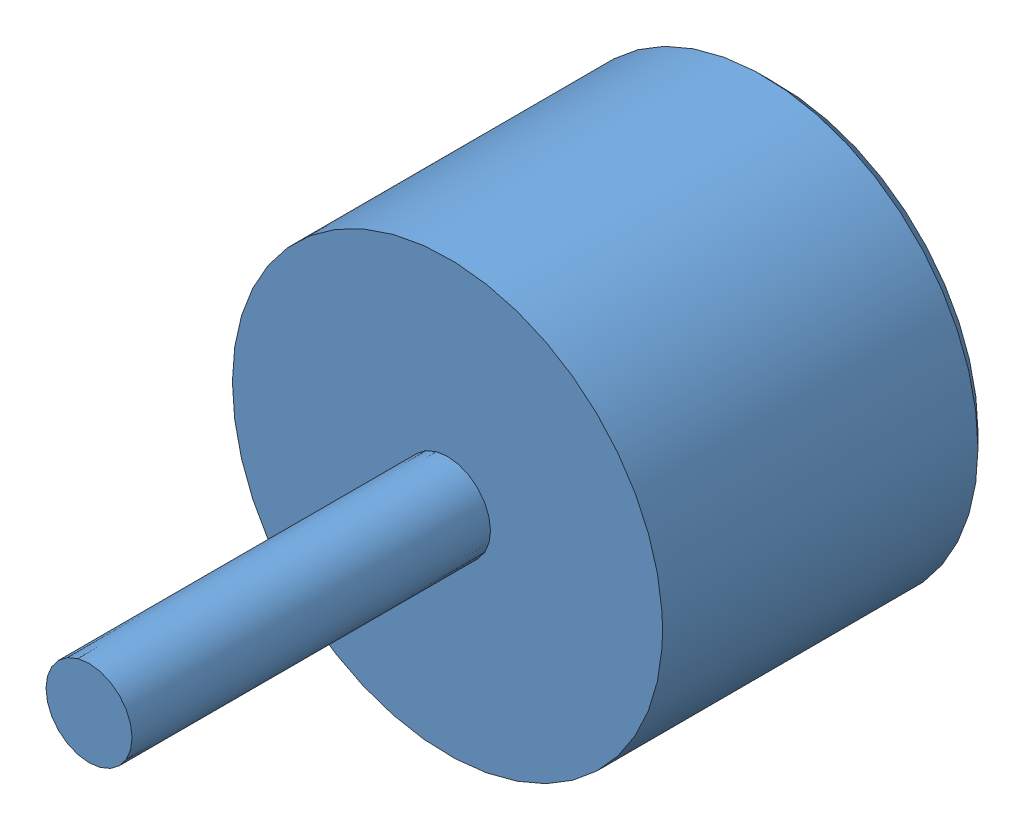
SolidWorks assembly AssemblageBOULE.SLDASM, configuration Défaut (file format 3400). Lengths in mm.
Overall size (60 60 102).
2 component instances, 2 part files, 2 mates.
Components (placement in the parent):
- BOULE-1: BOULE.SLDPRT [Défaut] at (-2.5035 -3.9478 0) size (60 60 96)
- La boule-1: La boule.SLDPRT [Défaut] at (-2.5035 -3.9478 12) size (36 36 36)
Mates (geometry in assembly coordinates):
- Coaxiale1: concentric: cylinder of BOULE-1; sphere of La boule-1
- Tangent2: tangent anti-aligned: plane of BOULE-1 through (-2.5035 -3.9478 30) normal (0 0 -1); sphere of La boule-1
